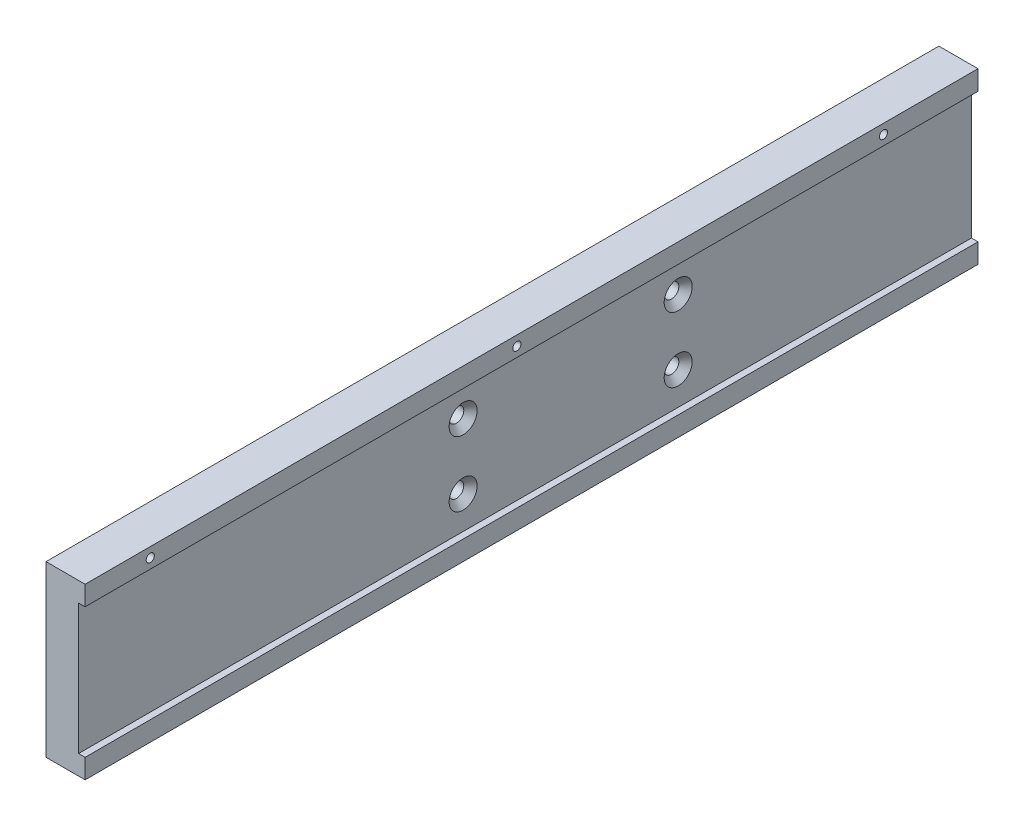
ISO-10303-21;
HEADER;
FILE_DESCRIPTION(('STEP AP214'),'2;1');
FILE_NAME('part.step','',(''),(''),'','','');
FILE_SCHEMA(('AUTOMOTIVE_DESIGN { 1 0 10303 214 1 1 1 1 }'));
ENDSEC;
DATA;
#1=APPLICATION_CONTEXT('core data for automotive mechanical design processes');
#2=APPLICATION_PROTOCOL_DEFINITION('international standard','automotive_design',2000,#1);
#3=PRODUCT_CONTEXT('',#1,'mechanical');
#4=PRODUCT('Part','Part','',(#3));
#5=PRODUCT_RELATED_PRODUCT_CATEGORY('part','',(#4));
#6=PRODUCT_DEFINITION_FORMATION('','',#4);
#7=PRODUCT_DEFINITION_CONTEXT('part definition',#1,'design');
#8=PRODUCT_DEFINITION('design','',#6,#7);
#9=PRODUCT_DEFINITION_SHAPE('','',#8);
#10=(LENGTH_UNIT() NAMED_UNIT(*) SI_UNIT(.MILLI.,.METRE.));
#11=(NAMED_UNIT(*) PLANE_ANGLE_UNIT() SI_UNIT($,.RADIAN.));
#12=(NAMED_UNIT(*) SI_UNIT($,.STERADIAN.) SOLID_ANGLE_UNIT());
#13=UNCERTAINTY_MEASURE_WITH_UNIT(LENGTH_MEASURE(1.E-05),#10,'distance_accuracy_value','');
#14=(GEOMETRIC_REPRESENTATION_CONTEXT(3) GLOBAL_UNCERTAINTY_ASSIGNED_CONTEXT((#13)) GLOBAL_UNIT_ASSIGNED_CONTEXT((#10,
#11,#12)) REPRESENTATION_CONTEXT('',''));
#15=CARTESIAN_POINT('',(0.,0.,0.));
#16=DIRECTION('',(0.,0.,1.));
#17=DIRECTION('',(1.,0.,0.));
#18=AXIS2_PLACEMENT_3D('',#15,#16,#17);
#19=CARTESIAN_POINT('',(110.,28.802471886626,302.));
#20=DIRECTION('',(-1.,0.,0.));
#21=DIRECTION('',(0.,0.,1.));
#22=AXIS2_PLACEMENT_3D('',#19,#20,#21);
#23=PLANE('',#22);
#24=CARTESIAN_POINT('',(110.,18.802471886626,118.));
#25=DIRECTION('',(1.,0.,0.));
#26=DIRECTION('',(0.,0.,-1.));
#27=AXIS2_PLACEMENT_3D('',#24,#25,#26);
#28=CIRCLE('',#27,4.3);
#29=CARTESIAN_POINT('',(110.,18.802471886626,113.7));
#30=VERTEX_POINT('',#29);
#31=EDGE_CURVE('E187',#30,#30,#28,.T.);
#32=ORIENTED_EDGE('',*,*,#31,.F.);
#33=EDGE_LOOP('',(#32));
#34=FACE_BOUND('',#33,.T.);
#35=CARTESIAN_POINT('',(110.,-1.19752811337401,184.));
#36=DIRECTION('',(1.,0.,0.));
#37=DIRECTION('',(0.,0.,-1.));
#38=AXIS2_PLACEMENT_3D('',#35,#36,#37);
#39=CIRCLE('',#38,4.3);
#40=CARTESIAN_POINT('',(110.,-1.19752811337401,179.7));
#41=VERTEX_POINT('',#40);
#42=EDGE_CURVE('E205',#41,#41,#39,.T.);
#43=ORIENTED_EDGE('',*,*,#42,.F.);
#44=EDGE_LOOP('',(#43));
#45=FACE_BOUND('',#44,.T.);
#46=CARTESIAN_POINT('',(110.,18.802471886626,184.));
#47=DIRECTION('',(1.,0.,0.));
#48=DIRECTION('',(0.,0.,-1.));
#49=AXIS2_PLACEMENT_3D('',#46,#47,#48);
#50=CIRCLE('',#49,4.3);
#51=CARTESIAN_POINT('',(110.,18.802471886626,179.7));
#52=VERTEX_POINT('',#51);
#53=EDGE_CURVE('E214',#52,#52,#50,.T.);
#54=ORIENTED_EDGE('',*,*,#53,.F.);
#55=EDGE_LOOP('',(#54));
#56=FACE_BOUND('',#55,.T.);
#57=DIRECTION('',(0.,0.,-1.));
#58=VECTOR('',#57,1.);
#59=CARTESIAN_POINT('',(110.,-11.197528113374,302.));
#60=LINE('',#59,#58);
#61=CARTESIAN_POINT('',(110.,-11.197528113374,302.));
#62=VERTEX_POINT('',#61);
#63=CARTESIAN_POINT('',(110.,-11.197528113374,28.));
#64=VERTEX_POINT('',#63);
#65=EDGE_CURVE('E130',#62,#64,#60,.T.);
#66=ORIENTED_EDGE('',*,*,#65,.T.);
#67=DIRECTION('',(0.,1.,0.));
#68=VECTOR('',#67,1.);
#69=CARTESIAN_POINT('',(110.,28.802471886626,28.));
#70=LINE('',#69,#68);
#71=CARTESIAN_POINT('',(110.,28.802471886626,28.));
#72=VERTEX_POINT('',#71);
#73=EDGE_CURVE('E150',#64,#72,#70,.T.);
#74=ORIENTED_EDGE('',*,*,#73,.T.);
#75=DIRECTION('',(0.,0.,-1.));
#76=VECTOR('',#75,1.);
#77=CARTESIAN_POINT('',(110.,28.802471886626,302.));
#78=LINE('',#77,#76);
#79=CARTESIAN_POINT('',(110.,28.802471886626,302.));
#80=VERTEX_POINT('',#79);
#81=EDGE_CURVE('E127',#80,#72,#78,.T.);
#82=ORIENTED_EDGE('',*,*,#81,.F.);
#83=DIRECTION('',(0.,1.,0.));
#84=VECTOR('',#83,1.);
#85=CARTESIAN_POINT('',(110.,28.802471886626,302.));
#86=LINE('',#85,#84);
#87=EDGE_CURVE('E113',#62,#80,#86,.T.);
#88=ORIENTED_EDGE('',*,*,#87,.F.);
#89=EDGE_LOOP('',(#66,#74,#82,#88));
#90=FACE_BOUND('',#89,.T.);
#91=CARTESIAN_POINT('',(110.,-1.19752811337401,118.));
#92=DIRECTION('',(1.,0.,0.));
#93=DIRECTION('',(0.,0.,-1.));
#94=AXIS2_PLACEMENT_3D('',#91,#92,#93);
#95=CIRCLE('',#94,4.3);
#96=CARTESIAN_POINT('',(110.,-1.19752811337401,113.7));
#97=VERTEX_POINT('',#96);
#98=EDGE_CURVE('E196',#97,#97,#95,.T.);
#99=ORIENTED_EDGE('',*,*,#98,.F.);
#100=EDGE_LOOP('',(#99));
#101=FACE_BOUND('',#100,.T.);
#102=ADVANCED_FACE('F16',(#34,#45,#56,#90,#101),#23,.F.);
#103=CARTESIAN_POINT('',(100.,34.802471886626,302.));
#104=DIRECTION('',(1.,0.,0.));
#105=DIRECTION('',(0.,0.,-1.));
#106=AXIS2_PLACEMENT_3D('',#103,#104,#105);
#107=PLANE('',#106);
#108=CARTESIAN_POINT('',(100.,31.802471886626,282.));
#109=DIRECTION('',(1.,0.,0.));
#110=DIRECTION('',(0.,0.,-1.));
#111=AXIS2_PLACEMENT_3D('',#108,#109,#110);
#112=CIRCLE('',#111,1.25);
#113=CARTESIAN_POINT('',(100.,31.802471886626,280.75));
#114=VERTEX_POINT('',#113);
#115=EDGE_CURVE('E172',#114,#114,#112,.T.);
#116=ORIENTED_EDGE('',*,*,#115,.T.);
#117=EDGE_LOOP('',(#116));
#118=FACE_BOUND('',#117,.T.);
#119=CARTESIAN_POINT('',(100.,31.802471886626,169.5));
#120=DIRECTION('',(1.,0.,0.));
#121=DIRECTION('',(0.,0.,-1.));
#122=AXIS2_PLACEMENT_3D('',#119,#120,#121);
#123=CIRCLE('',#122,1.25);
#124=CARTESIAN_POINT('',(100.,31.802471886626,168.25));
#125=VERTEX_POINT('',#124);
#126=EDGE_CURVE('E178',#125,#125,#123,.T.);
#127=ORIENTED_EDGE('',*,*,#126,.T.);
#128=EDGE_LOOP('',(#127));
#129=FACE_BOUND('',#128,.T.);
#130=CARTESIAN_POINT('',(100.,31.802471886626,57.));
#131=DIRECTION('',(1.,0.,0.));
#132=DIRECTION('',(0.,0.,-1.));
#133=AXIS2_PLACEMENT_3D('',#130,#131,#132);
#134=CIRCLE('',#133,1.25);
#135=CARTESIAN_POINT('',(100.,31.802471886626,55.75));
#136=VERTEX_POINT('',#135);
#137=EDGE_CURVE('E184',#136,#136,#134,.T.);
#138=ORIENTED_EDGE('',*,*,#137,.T.);
#139=EDGE_LOOP('',(#138));
#140=FACE_BOUND('',#139,.T.);
#141=CARTESIAN_POINT('',(100.,18.802471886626,118.));
#142=DIRECTION('',(1.,0.,0.));
#143=DIRECTION('',(0.,0.,-1.));
#144=AXIS2_PLACEMENT_3D('',#141,#142,#143);
#145=CIRCLE('',#144,2.25);
#146=CARTESIAN_POINT('',(100.,18.802471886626,115.75));
#147=VERTEX_POINT('',#146);
#148=EDGE_CURVE('E193',#147,#147,#145,.T.);
#149=ORIENTED_EDGE('',*,*,#148,.T.);
#150=EDGE_LOOP('',(#149));
#151=FACE_BOUND('',#150,.T.);
#152=CARTESIAN_POINT('',(100.,-1.19752811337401,118.));
#153=DIRECTION('',(1.,0.,0.));
#154=DIRECTION('',(0.,0.,-1.));
#155=AXIS2_PLACEMENT_3D('',#152,#153,#154);
#156=CIRCLE('',#155,2.25);
#157=CARTESIAN_POINT('',(100.,-1.19752811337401,115.75));
#158=VERTEX_POINT('',#157);
#159=EDGE_CURVE('E202',#158,#158,#156,.T.);
#160=ORIENTED_EDGE('',*,*,#159,.T.);
#161=EDGE_LOOP('',(#160));
#162=FACE_BOUND('',#161,.T.);
#163=CARTESIAN_POINT('',(100.,-1.19752811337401,184.));
#164=DIRECTION('',(1.,0.,0.));
#165=DIRECTION('',(0.,0.,-1.));
#166=AXIS2_PLACEMENT_3D('',#163,#164,#165);
#167=CIRCLE('',#166,2.25);
#168=CARTESIAN_POINT('',(100.,-1.19752811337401,181.75));
#169=VERTEX_POINT('',#168);
#170=EDGE_CURVE('E211',#169,#169,#167,.T.);
#171=ORIENTED_EDGE('',*,*,#170,.T.);
#172=EDGE_LOOP('',(#171));
#173=FACE_BOUND('',#172,.T.);
#174=CARTESIAN_POINT('',(100.,18.802471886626,184.));
#175=DIRECTION('',(1.,0.,0.));
#176=DIRECTION('',(0.,0.,-1.));
#177=AXIS2_PLACEMENT_3D('',#174,#175,#176);
#178=CIRCLE('',#177,2.25);
#179=CARTESIAN_POINT('',(100.,18.802471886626,181.75));
#180=VERTEX_POINT('',#179);
#181=EDGE_CURVE('E103',#180,#180,#178,.T.);
#182=ORIENTED_EDGE('',*,*,#181,.T.);
#183=EDGE_LOOP('',(#182));
#184=FACE_BOUND('',#183,.T.);
#185=DIRECTION('',(0.,0.,-1.));
#186=VECTOR('',#185,1.);
#187=CARTESIAN_POINT('',(100.,34.802471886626,302.));
#188=LINE('',#187,#186);
#189=CARTESIAN_POINT('',(100.,34.802471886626,302.));
#190=VERTEX_POINT('',#189);
#191=CARTESIAN_POINT('',(100.,34.802471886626,28.));
#192=VERTEX_POINT('',#191);
#193=EDGE_CURVE('E93',#190,#192,#188,.T.);
#194=ORIENTED_EDGE('',*,*,#193,.T.);
#195=DIRECTION('',(0.,1.,0.));
#196=VECTOR('',#195,1.);
#197=CARTESIAN_POINT('',(100.,-17.197528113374,28.));
#198=LINE('',#197,#196);
#199=CARTESIAN_POINT('',(100.,-17.197528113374,28.));
#200=VERTEX_POINT('',#199);
#201=EDGE_CURVE('E31',#200,#192,#198,.T.);
#202=ORIENTED_EDGE('',*,*,#201,.F.);
#203=DIRECTION('',(0.,0.,-1.));
#204=VECTOR('',#203,1.);
#205=CARTESIAN_POINT('',(100.,-17.197528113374,302.));
#206=LINE('',#205,#204);
#207=CARTESIAN_POINT('',(100.,-17.197528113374,302.));
#208=VERTEX_POINT('',#207);
#209=EDGE_CURVE('E11',#208,#200,#206,.T.);
#210=ORIENTED_EDGE('',*,*,#209,.F.);
#211=DIRECTION('',(0.,-1.,0.));
#212=VECTOR('',#211,1.);
#213=CARTESIAN_POINT('',(100.,34.802471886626,302.));
#214=LINE('',#213,#212);
#215=EDGE_CURVE('E100',#190,#208,#214,.T.);
#216=ORIENTED_EDGE('',*,*,#215,.F.);
#217=EDGE_LOOP('',(#194,#202,#210,#216));
#218=FACE_BOUND('',#217,.T.);
#219=ADVANCED_FACE('F18',(#118,#129,#140,#151,#162,#173,#184,#218),#107,.F.);
#220=CARTESIAN_POINT('',(100.,-17.197528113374,302.));
#221=DIRECTION('',(0.,1.,0.));
#222=DIRECTION('',(0.,0.,1.));
#223=AXIS2_PLACEMENT_3D('',#220,#221,#222);
#224=PLANE('',#223);
#225=ORIENTED_EDGE('',*,*,#209,.T.);
#226=DIRECTION('',(1.,0.,0.));
#227=VECTOR('',#226,1.);
#228=CARTESIAN_POINT('',(100.,-17.197528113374,28.));
#229=LINE('',#228,#227);
#230=CARTESIAN_POINT('',(112.,-17.197528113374,28.));
#231=VERTEX_POINT('',#230);
#232=EDGE_CURVE('E80',#200,#231,#229,.T.);
#233=ORIENTED_EDGE('',*,*,#232,.T.);
#234=DIRECTION('',(0.,0.,-1.));
#235=VECTOR('',#234,1.);
#236=CARTESIAN_POINT('',(112.,-17.197528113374,302.));
#237=LINE('',#236,#235);
#238=CARTESIAN_POINT('',(112.,-17.197528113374,302.));
#239=VERTEX_POINT('',#238);
#240=EDGE_CURVE('E24',#239,#231,#237,.T.);
#241=ORIENTED_EDGE('',*,*,#240,.F.);
#242=DIRECTION('',(1.,0.,0.));
#243=VECTOR('',#242,1.);
#244=CARTESIAN_POINT('',(100.,-17.197528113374,302.));
#245=LINE('',#244,#243);
#246=EDGE_CURVE('E97',#208,#239,#245,.T.);
#247=ORIENTED_EDGE('',*,*,#246,.F.);
#248=EDGE_LOOP('',(#225,#233,#241,#247));
#249=FACE_BOUND('',#248,.T.);
#250=ADVANCED_FACE('F96',(#249),#224,.F.);
#251=CARTESIAN_POINT('',(112.,-11.197528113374,302.));
#252=DIRECTION('',(-1.,0.,0.));
#253=DIRECTION('',(0.,0.,1.));
#254=AXIS2_PLACEMENT_3D('',#251,#252,#253);
#255=PLANE('',#254);
#256=ORIENTED_EDGE('',*,*,#240,.T.);
#257=DIRECTION('',(0.,1.,0.));
#258=VECTOR('',#257,1.);
#259=CARTESIAN_POINT('',(112.,-17.197528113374,28.));
#260=LINE('',#259,#258);
#261=CARTESIAN_POINT('',(112.,-11.197528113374,28.));
#262=VERTEX_POINT('',#261);
#263=EDGE_CURVE('E83',#231,#262,#260,.T.);
#264=ORIENTED_EDGE('',*,*,#263,.T.);
#265=DIRECTION('',(0.,0.,-1.));
#266=VECTOR('',#265,1.);
#267=CARTESIAN_POINT('',(112.,-11.197528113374,302.));
#268=LINE('',#267,#266);
#269=CARTESIAN_POINT('',(112.,-11.197528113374,302.));
#270=VERTEX_POINT('',#269);
#271=EDGE_CURVE('E133',#270,#262,#268,.T.);
#272=ORIENTED_EDGE('',*,*,#271,.F.);
#273=DIRECTION('',(0.,1.,0.));
#274=VECTOR('',#273,1.);
#275=CARTESIAN_POINT('',(112.,-11.197528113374,302.));
#276=LINE('',#275,#274);
#277=EDGE_CURVE('E99',#239,#270,#276,.T.);
#278=ORIENTED_EDGE('',*,*,#277,.F.);
#279=EDGE_LOOP('',(#256,#264,#272,#278));
#280=FACE_BOUND('',#279,.T.);
#281=ADVANCED_FACE('F136',(#280),#255,.F.);
#282=CARTESIAN_POINT('',(112.,-11.197528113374,302.));
#283=DIRECTION('',(0.,-1.,0.));
#284=DIRECTION('',(1.,0.,0.));
#285=AXIS2_PLACEMENT_3D('',#282,#283,#284);
#286=PLANE('',#285);
#287=ORIENTED_EDGE('',*,*,#271,.T.);
#288=DIRECTION('',(-1.,0.,0.));
#289=VECTOR('',#288,1.);
#290=CARTESIAN_POINT('',(112.,-11.197528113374,28.));
#291=LINE('',#290,#289);
#292=EDGE_CURVE('E145',#262,#64,#291,.T.);
#293=ORIENTED_EDGE('',*,*,#292,.T.);
#294=ORIENTED_EDGE('',*,*,#65,.F.);
#295=DIRECTION('',(-1.,0.,0.));
#296=VECTOR('',#295,1.);
#297=CARTESIAN_POINT('',(112.,-11.197528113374,302.));
#298=LINE('',#297,#296);
#299=EDGE_CURVE('E111',#270,#62,#298,.T.);
#300=ORIENTED_EDGE('',*,*,#299,.F.);
#301=EDGE_LOOP('',(#287,#293,#294,#300));
#302=FACE_BOUND('',#301,.T.);
#303=ADVANCED_FACE('F144',(#302),#286,.F.);
#304=CARTESIAN_POINT('',(112.,28.802471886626,302.));
#305=DIRECTION('',(0.,1.,0.));
#306=DIRECTION('',(0.,0.,1.));
#307=AXIS2_PLACEMENT_3D('',#304,#305,#306);
#308=PLANE('',#307);
#309=ORIENTED_EDGE('',*,*,#81,.T.);
#310=DIRECTION('',(1.,0.,0.));
#311=VECTOR('',#310,1.);
#312=CARTESIAN_POINT('',(112.,28.802471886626,28.));
#313=LINE('',#312,#311);
#314=CARTESIAN_POINT('',(112.,28.802471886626,28.));
#315=VERTEX_POINT('',#314);
#316=EDGE_CURVE('E164',#72,#315,#313,.T.);
#317=ORIENTED_EDGE('',*,*,#316,.T.);
#318=DIRECTION('',(0.,0.,-1.));
#319=VECTOR('',#318,1.);
#320=CARTESIAN_POINT('',(112.,28.802471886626,302.));
#321=LINE('',#320,#319);
#322=CARTESIAN_POINT('',(112.,28.802471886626,302.));
#323=VERTEX_POINT('',#322);
#324=EDGE_CURVE('E124',#323,#315,#321,.T.);
#325=ORIENTED_EDGE('',*,*,#324,.F.);
#326=DIRECTION('',(1.,0.,0.));
#327=VECTOR('',#326,1.);
#328=CARTESIAN_POINT('',(112.,28.802471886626,302.));
#329=LINE('',#328,#327);
#330=EDGE_CURVE('E115',#80,#323,#329,.T.);
#331=ORIENTED_EDGE('',*,*,#330,.F.);
#332=EDGE_LOOP('',(#309,#317,#325,#331));
#333=FACE_BOUND('',#332,.T.);
#334=ADVANCED_FACE('F154',(#333),#308,.F.);
#335=CARTESIAN_POINT('',(112.,34.802471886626,302.));
#336=DIRECTION('',(-1.,0.,0.));
#337=DIRECTION('',(0.,0.,1.));
#338=AXIS2_PLACEMENT_3D('',#335,#336,#337);
#339=PLANE('',#338);
#340=CARTESIAN_POINT('',(112.,31.802471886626,282.));
#341=DIRECTION('',(1.,0.,0.));
#342=DIRECTION('',(0.,0.,-1.));
#343=AXIS2_PLACEMENT_3D('',#340,#341,#342);
#344=CIRCLE('',#343,1.25);
#345=CARTESIAN_POINT('',(112.,31.802471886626,280.75));
#346=VERTEX_POINT('',#345);
#347=EDGE_CURVE('E169',#346,#346,#344,.T.);
#348=ORIENTED_EDGE('',*,*,#347,.F.);
#349=EDGE_LOOP('',(#348));
#350=FACE_BOUND('',#349,.T.);
#351=CARTESIAN_POINT('',(112.,31.802471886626,169.5));
#352=DIRECTION('',(1.,0.,0.));
#353=DIRECTION('',(0.,0.,-1.));
#354=AXIS2_PLACEMENT_3D('',#351,#352,#353);
#355=CIRCLE('',#354,1.25);
#356=CARTESIAN_POINT('',(112.,31.802471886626,168.25));
#357=VERTEX_POINT('',#356);
#358=EDGE_CURVE('E175',#357,#357,#355,.T.);
#359=ORIENTED_EDGE('',*,*,#358,.F.);
#360=EDGE_LOOP('',(#359));
#361=FACE_BOUND('',#360,.T.);
#362=CARTESIAN_POINT('',(112.,31.802471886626,57.));
#363=DIRECTION('',(1.,0.,0.));
#364=DIRECTION('',(0.,0.,-1.));
#365=AXIS2_PLACEMENT_3D('',#362,#363,#364);
#366=CIRCLE('',#365,1.25);
#367=CARTESIAN_POINT('',(112.,31.802471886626,55.75));
#368=VERTEX_POINT('',#367);
#369=EDGE_CURVE('E181',#368,#368,#366,.T.);
#370=ORIENTED_EDGE('',*,*,#369,.F.);
#371=EDGE_LOOP('',(#370));
#372=FACE_BOUND('',#371,.T.);
#373=ORIENTED_EDGE('',*,*,#324,.T.);
#374=CARTESIAN_POINT('',(112.,34.802471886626,28.));
#375=VERTEX_POINT('',#374);
#376=EDGE_CURVE('E94',#315,#375,#260,.T.);
#377=ORIENTED_EDGE('',*,*,#376,.T.);
#378=DIRECTION('',(0.,0.,-1.));
#379=VECTOR('',#378,1.);
#380=CARTESIAN_POINT('',(112.,34.802471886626,302.));
#381=LINE('',#380,#379);
#382=CARTESIAN_POINT('',(112.,34.802471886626,302.));
#383=VERTEX_POINT('',#382);
#384=EDGE_CURVE('E121',#383,#375,#381,.T.);
#385=ORIENTED_EDGE('',*,*,#384,.F.);
#386=DIRECTION('',(0.,1.,0.));
#387=VECTOR('',#386,1.);
#388=CARTESIAN_POINT('',(112.,34.802471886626,302.));
#389=LINE('',#388,#387);
#390=EDGE_CURVE('E117',#323,#383,#389,.T.);
#391=ORIENTED_EDGE('',*,*,#390,.F.);
#392=EDGE_LOOP('',(#373,#377,#385,#391));
#393=FACE_BOUND('',#392,.T.);
#394=ADVANCED_FACE('F159',(#350,#361,#372,#393),#339,.F.);
#395=CARTESIAN_POINT('',(100.,34.802471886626,302.));
#396=DIRECTION('',(0.,-1.,0.));
#397=DIRECTION('',(1.,0.,0.));
#398=AXIS2_PLACEMENT_3D('',#395,#396,#397);
#399=PLANE('',#398);
#400=ORIENTED_EDGE('',*,*,#384,.T.);
#401=DIRECTION('',(1.,0.,0.));
#402=VECTOR('',#401,1.);
#403=CARTESIAN_POINT('',(100.,34.802471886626,28.));
#404=LINE('',#403,#402);
#405=EDGE_CURVE('E87',#192,#375,#404,.T.);
#406=ORIENTED_EDGE('',*,*,#405,.F.);
#407=ORIENTED_EDGE('',*,*,#193,.F.);
#408=DIRECTION('',(-1.,0.,0.));
#409=VECTOR('',#408,1.);
#410=CARTESIAN_POINT('',(100.,34.802471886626,302.));
#411=LINE('',#410,#409);
#412=EDGE_CURVE('E39',#383,#190,#411,.T.);
#413=ORIENTED_EDGE('',*,*,#412,.F.);
#414=EDGE_LOOP('',(#400,#406,#407,#413));
#415=FACE_BOUND('',#414,.T.);
#416=ADVANCED_FACE('F161',(#415),#399,.F.);
#417=CARTESIAN_POINT('',(0.,0.,302.));
#418=DIRECTION('',(0.,0.,1.));
#419=DIRECTION('',(1.,0.,0.));
#420=AXIS2_PLACEMENT_3D('',#417,#418,#419);
#421=PLANE('',#420);
#422=ORIENTED_EDGE('',*,*,#215,.T.);
#423=ORIENTED_EDGE('',*,*,#246,.T.);
#424=ORIENTED_EDGE('',*,*,#277,.T.);
#425=ORIENTED_EDGE('',*,*,#299,.T.);
#426=ORIENTED_EDGE('',*,*,#87,.T.);
#427=ORIENTED_EDGE('',*,*,#330,.T.);
#428=ORIENTED_EDGE('',*,*,#390,.T.);
#429=ORIENTED_EDGE('',*,*,#412,.T.);
#430=EDGE_LOOP('',(#422,#423,#424,#425,#426,#427,#428,#429));
#431=FACE_BOUND('',#430,.T.);
#432=ADVANCED_FACE('F102',(#431),#421,.T.);
#433=CARTESIAN_POINT('',(110.,18.802471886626,184.));
#434=DIRECTION('',(1.,0.,0.));
#435=DIRECTION('',(0.,0.,-1.));
#436=AXIS2_PLACEMENT_3D('',#433,#434,#435);
#437=CYLINDRICAL_SURFACE('',#436,2.25);
#438=ORIENTED_EDGE('',*,*,#181,.F.);
#439=EDGE_LOOP('',(#438));
#440=FACE_BOUND('',#439,.T.);
#441=CARTESIAN_POINT('',(107.95,18.802471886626,184.));
#442=DIRECTION('',(1.,0.,0.));
#443=DIRECTION('',(0.,0.,-1.));
#444=AXIS2_PLACEMENT_3D('',#441,#442,#443);
#445=CIRCLE('',#444,2.25);
#446=CARTESIAN_POINT('',(107.95,18.802471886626,181.75));
#447=VERTEX_POINT('',#446);
#448=EDGE_CURVE('E106',#447,#447,#445,.T.);
#449=ORIENTED_EDGE('',*,*,#448,.T.);
#450=EDGE_LOOP('',(#449));
#451=FACE_BOUND('',#450,.T.);
#452=ADVANCED_FACE('F219',(#440,#451),#437,.F.);
#453=CARTESIAN_POINT('',(110.,18.802471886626,184.));
#454=DIRECTION('',(1.,0.,0.));
#455=DIRECTION('',(0.,0.,-1.));
#456=AXIS2_PLACEMENT_3D('',#453,#454,#455);
#457=CONICAL_SURFACE('',#456,4.3,0.785398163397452);
#458=ORIENTED_EDGE('',*,*,#448,.F.);
#459=EDGE_LOOP('',(#458));
#460=FACE_BOUND('',#459,.T.);
#461=ORIENTED_EDGE('',*,*,#53,.T.);
#462=EDGE_LOOP('',(#461));
#463=FACE_BOUND('',#462,.T.);
#464=ADVANCED_FACE('F221',(#460,#463),#457,.F.);
#465=CARTESIAN_POINT('',(110.,-1.19752811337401,184.));
#466=DIRECTION('',(1.,0.,0.));
#467=DIRECTION('',(0.,0.,-1.));
#468=AXIS2_PLACEMENT_3D('',#465,#466,#467);
#469=CYLINDRICAL_SURFACE('',#468,2.25);
#470=ORIENTED_EDGE('',*,*,#170,.F.);
#471=EDGE_LOOP('',(#470));
#472=FACE_BOUND('',#471,.T.);
#473=CARTESIAN_POINT('',(107.95,-1.19752811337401,184.));
#474=DIRECTION('',(1.,0.,0.));
#475=DIRECTION('',(0.,0.,-1.));
#476=AXIS2_PLACEMENT_3D('',#473,#474,#475);
#477=CIRCLE('',#476,2.25);
#478=CARTESIAN_POINT('',(107.95,-1.19752811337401,181.75));
#479=VERTEX_POINT('',#478);
#480=EDGE_CURVE('E208',#479,#479,#477,.T.);
#481=ORIENTED_EDGE('',*,*,#480,.T.);
#482=EDGE_LOOP('',(#481));
#483=FACE_BOUND('',#482,.T.);
#484=ADVANCED_FACE('F224',(#472,#483),#469,.F.);
#485=CARTESIAN_POINT('',(110.,-1.19752811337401,184.));
#486=DIRECTION('',(1.,0.,0.));
#487=DIRECTION('',(0.,0.,-1.));
#488=AXIS2_PLACEMENT_3D('',#485,#486,#487);
#489=CONICAL_SURFACE('',#488,4.3,0.785398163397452);
#490=ORIENTED_EDGE('',*,*,#480,.F.);
#491=EDGE_LOOP('',(#490));
#492=FACE_BOUND('',#491,.T.);
#493=ORIENTED_EDGE('',*,*,#42,.T.);
#494=EDGE_LOOP('',(#493));
#495=FACE_BOUND('',#494,.T.);
#496=ADVANCED_FACE('F312',(#492,#495),#489,.F.);
#497=CARTESIAN_POINT('',(110.,-1.19752811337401,118.));
#498=DIRECTION('',(1.,0.,0.));
#499=DIRECTION('',(0.,0.,-1.));
#500=AXIS2_PLACEMENT_3D('',#497,#498,#499);
#501=CYLINDRICAL_SURFACE('',#500,2.25);
#502=ORIENTED_EDGE('',*,*,#159,.F.);
#503=EDGE_LOOP('',(#502));
#504=FACE_BOUND('',#503,.T.);
#505=CARTESIAN_POINT('',(107.95,-1.19752811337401,118.));
#506=DIRECTION('',(1.,0.,0.));
#507=DIRECTION('',(0.,0.,-1.));
#508=AXIS2_PLACEMENT_3D('',#505,#506,#507);
#509=CIRCLE('',#508,2.25);
#510=CARTESIAN_POINT('',(107.95,-1.19752811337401,115.75));
#511=VERTEX_POINT('',#510);
#512=EDGE_CURVE('E199',#511,#511,#509,.T.);
#513=ORIENTED_EDGE('',*,*,#512,.T.);
#514=EDGE_LOOP('',(#513));
#515=FACE_BOUND('',#514,.T.);
#516=ADVANCED_FACE('F321',(#504,#515),#501,.F.);
#517=CARTESIAN_POINT('',(110.,-1.19752811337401,118.));
#518=DIRECTION('',(1.,0.,0.));
#519=DIRECTION('',(0.,0.,-1.));
#520=AXIS2_PLACEMENT_3D('',#517,#518,#519);
#521=CONICAL_SURFACE('',#520,4.3,0.785398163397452);
#522=ORIENTED_EDGE('',*,*,#512,.F.);
#523=EDGE_LOOP('',(#522));
#524=FACE_BOUND('',#523,.T.);
#525=ORIENTED_EDGE('',*,*,#98,.T.);
#526=EDGE_LOOP('',(#525));
#527=FACE_BOUND('',#526,.T.);
#528=ADVANCED_FACE('F330',(#524,#527),#521,.F.);
#529=CARTESIAN_POINT('',(110.,18.802471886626,118.));
#530=DIRECTION('',(1.,0.,0.));
#531=DIRECTION('',(0.,0.,-1.));
#532=AXIS2_PLACEMENT_3D('',#529,#530,#531);
#533=CYLINDRICAL_SURFACE('',#532,2.25);
#534=ORIENTED_EDGE('',*,*,#148,.F.);
#535=EDGE_LOOP('',(#534));
#536=FACE_BOUND('',#535,.T.);
#537=CARTESIAN_POINT('',(107.95,18.802471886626,118.));
#538=DIRECTION('',(1.,0.,0.));
#539=DIRECTION('',(0.,0.,-1.));
#540=AXIS2_PLACEMENT_3D('',#537,#538,#539);
#541=CIRCLE('',#540,2.25);
#542=CARTESIAN_POINT('',(107.95,18.802471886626,115.75));
#543=VERTEX_POINT('',#542);
#544=EDGE_CURVE('E190',#543,#543,#541,.T.);
#545=ORIENTED_EDGE('',*,*,#544,.T.);
#546=EDGE_LOOP('',(#545));
#547=FACE_BOUND('',#546,.T.);
#548=ADVANCED_FACE('F339',(#536,#547),#533,.F.);
#549=CARTESIAN_POINT('',(110.,18.802471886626,118.));
#550=DIRECTION('',(1.,0.,0.));
#551=DIRECTION('',(0.,0.,-1.));
#552=AXIS2_PLACEMENT_3D('',#549,#550,#551);
#553=CONICAL_SURFACE('',#552,4.3,0.785398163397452);
#554=ORIENTED_EDGE('',*,*,#544,.F.);
#555=EDGE_LOOP('',(#554));
#556=FACE_BOUND('',#555,.T.);
#557=ORIENTED_EDGE('',*,*,#31,.T.);
#558=EDGE_LOOP('',(#557));
#559=FACE_BOUND('',#558,.T.);
#560=ADVANCED_FACE('F348',(#556,#559),#553,.F.);
#561=CARTESIAN_POINT('',(112.,31.802471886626,57.));
#562=DIRECTION('',(1.,0.,0.));
#563=DIRECTION('',(0.,0.,-1.));
#564=AXIS2_PLACEMENT_3D('',#561,#562,#563);
#565=CYLINDRICAL_SURFACE('',#564,1.25);
#566=ORIENTED_EDGE('',*,*,#137,.F.);
#567=EDGE_LOOP('',(#566));
#568=FACE_BOUND('',#567,.T.);
#569=ORIENTED_EDGE('',*,*,#369,.T.);
#570=EDGE_LOOP('',(#569));
#571=FACE_BOUND('',#570,.T.);
#572=ADVANCED_FACE('F357',(#568,#571),#565,.F.);
#573=CARTESIAN_POINT('',(112.,31.802471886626,169.5));
#574=DIRECTION('',(1.,0.,0.));
#575=DIRECTION('',(0.,0.,-1.));
#576=AXIS2_PLACEMENT_3D('',#573,#574,#575);
#577=CYLINDRICAL_SURFACE('',#576,1.25);
#578=ORIENTED_EDGE('',*,*,#126,.F.);
#579=EDGE_LOOP('',(#578));
#580=FACE_BOUND('',#579,.T.);
#581=ORIENTED_EDGE('',*,*,#358,.T.);
#582=EDGE_LOOP('',(#581));
#583=FACE_BOUND('',#582,.T.);
#584=ADVANCED_FACE('F366',(#580,#583),#577,.F.);
#585=CARTESIAN_POINT('',(112.,31.802471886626,282.));
#586=DIRECTION('',(1.,0.,0.));
#587=DIRECTION('',(0.,0.,-1.));
#588=AXIS2_PLACEMENT_3D('',#585,#586,#587);
#589=CYLINDRICAL_SURFACE('',#588,1.25);
#590=ORIENTED_EDGE('',*,*,#115,.F.);
#591=EDGE_LOOP('',(#590));
#592=FACE_BOUND('',#591,.T.);
#593=ORIENTED_EDGE('',*,*,#347,.T.);
#594=EDGE_LOOP('',(#593));
#595=FACE_BOUND('',#594,.T.);
#596=ADVANCED_FACE('F375',(#592,#595),#589,.F.);
#597=CARTESIAN_POINT('',(100.,-17.197528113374,28.));
#598=DIRECTION('',(0.,0.,1.));
#599=DIRECTION('',(1.,0.,0.));
#600=AXIS2_PLACEMENT_3D('',#597,#598,#599);
#601=PLANE('',#600);
#602=ORIENTED_EDGE('',*,*,#263,.F.);
#603=ORIENTED_EDGE('',*,*,#232,.F.);
#604=ORIENTED_EDGE('',*,*,#201,.T.);
#605=ORIENTED_EDGE('',*,*,#405,.T.);
#606=ORIENTED_EDGE('',*,*,#376,.F.);
#607=ORIENTED_EDGE('',*,*,#316,.F.);
#608=ORIENTED_EDGE('',*,*,#73,.F.);
#609=ORIENTED_EDGE('',*,*,#292,.F.);
#610=EDGE_LOOP('',(#602,#603,#604,#605,#606,#607,#608,#609));
#611=FACE_BOUND('',#610,.T.);
#612=ADVANCED_FACE('F81',(#611),#601,.F.);
#613=CLOSED_SHELL('',(#102,#219,#250,#281,#303,#334,#394,#416,#432,#452,#464,#484,#496,#516,
#528,#548,#560,#572,#584,#596,#612));
#614=MANIFOLD_SOLID_BREP('B1',#613);
#615=ADVANCED_BREP_SHAPE_REPRESENTATION('',(#18,#614),#14);
#616=SHAPE_DEFINITION_REPRESENTATION(#9,#615);
ENDSEC;
END-ISO-10303-21;
